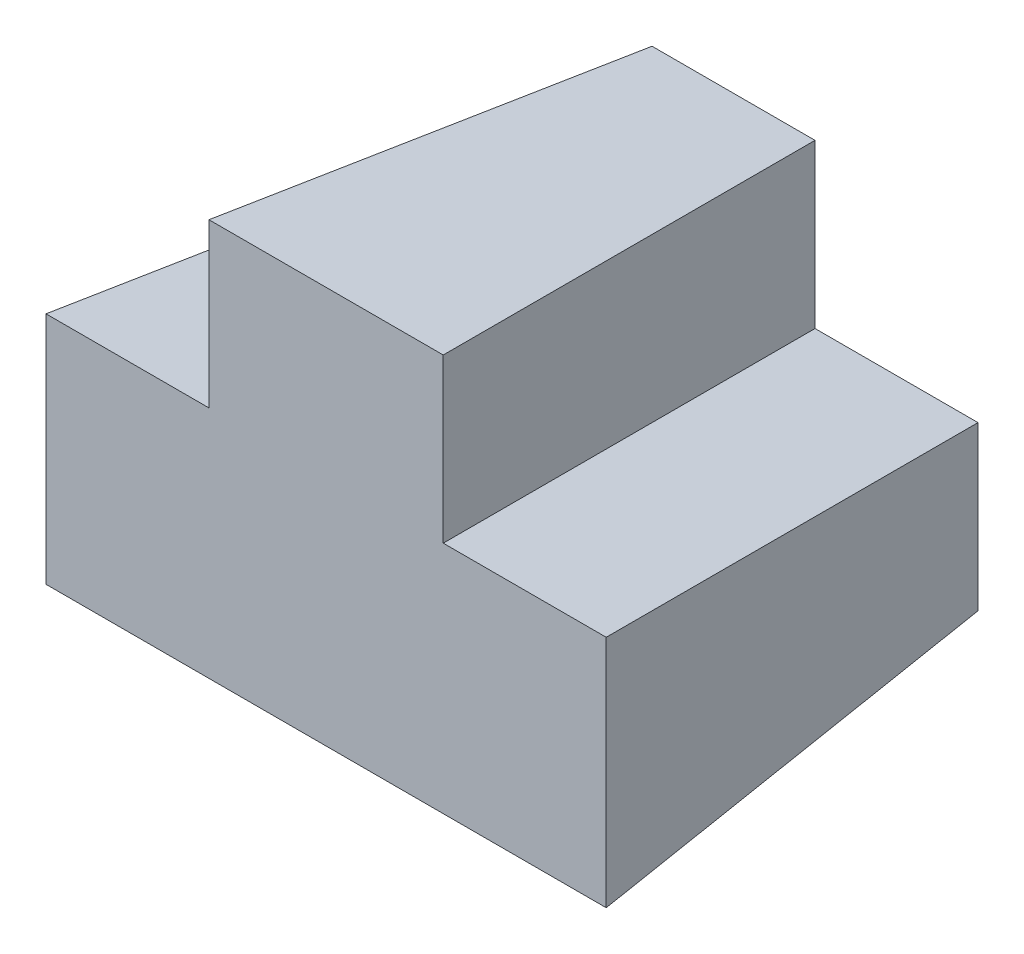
from build123d import *

# Parameters (mm, degrees)
BOSS_EXTRUDE1_DEPTH = 20
BOSS_EXTRUDE1_DRAFT = -5


with BuildPart() as part:
    # Sketch1 → Boss-Extrude1 (with draft: the straight prism first)
    with BuildSketch(Plane.XY):
        Polygon((12, 0), (12, 8), (4, 8), (4, 16), (-4, 16), (-4, 8), (-12, 8), (-12, 0), align=None)
    extrude(amount=BOSS_EXTRUDE1_DEPTH)
    # Boss-Extrude1: the draft: its side faces are tilted about the plane it starts from
    boss_extrude1_sides = [part.faces().sort_by_distance(p)[0] for p in [
        (12, 4, 10),
        (8, 8, 10),
        (4, 12, 10),
        (0, 16, 10),
        (-4, 12, 10),
        (-8, 8, 10),
        (-12, 4, 10),
        (0, 0, 10),
    ]]
    draft(boss_extrude1_sides, Plane.XY, BOSS_EXTRUDE1_DRAFT)


solid = part.part
